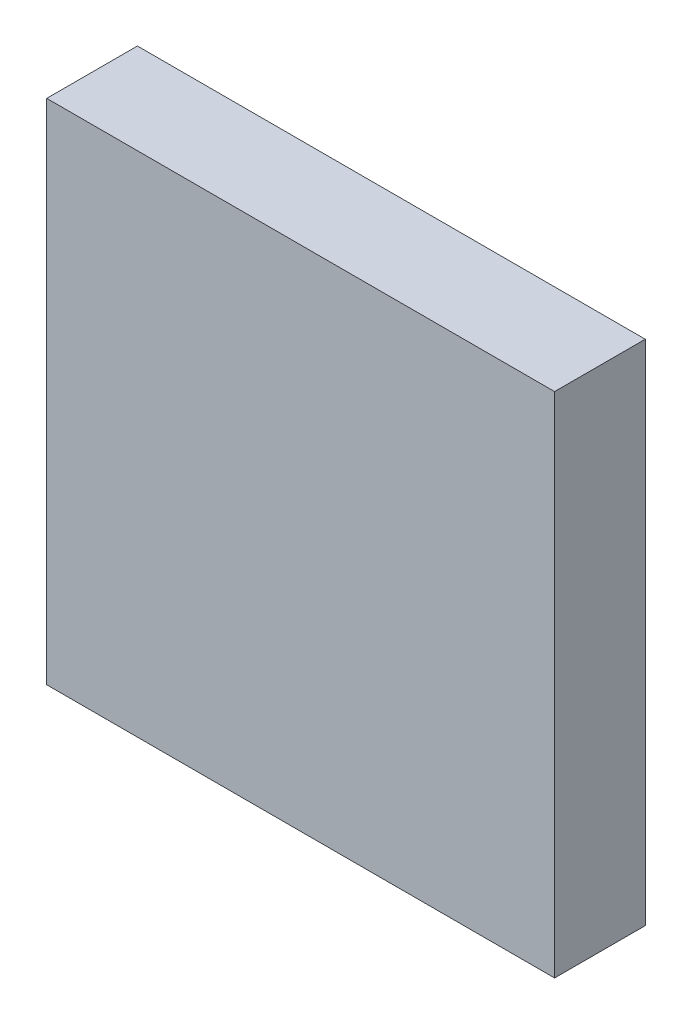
from build123d import *

# Parameters (mm, degrees)
ESQUISSE1_W        = 168
ESQUISSE1_H        = 168
BOSS_EXTRU_1_DEPTH = 30


with BuildPart() as part:
    # Esquisse1 → Boss.-Extru.1 (new body)
    with BuildSketch(Plane.XY):
        with Locations((38.552873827, -47.777574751)):
            Rectangle(ESQUISSE1_W, ESQUISSE1_H)
    extrude(amount=BOSS_EXTRU_1_DEPTH)


solid = part.part
